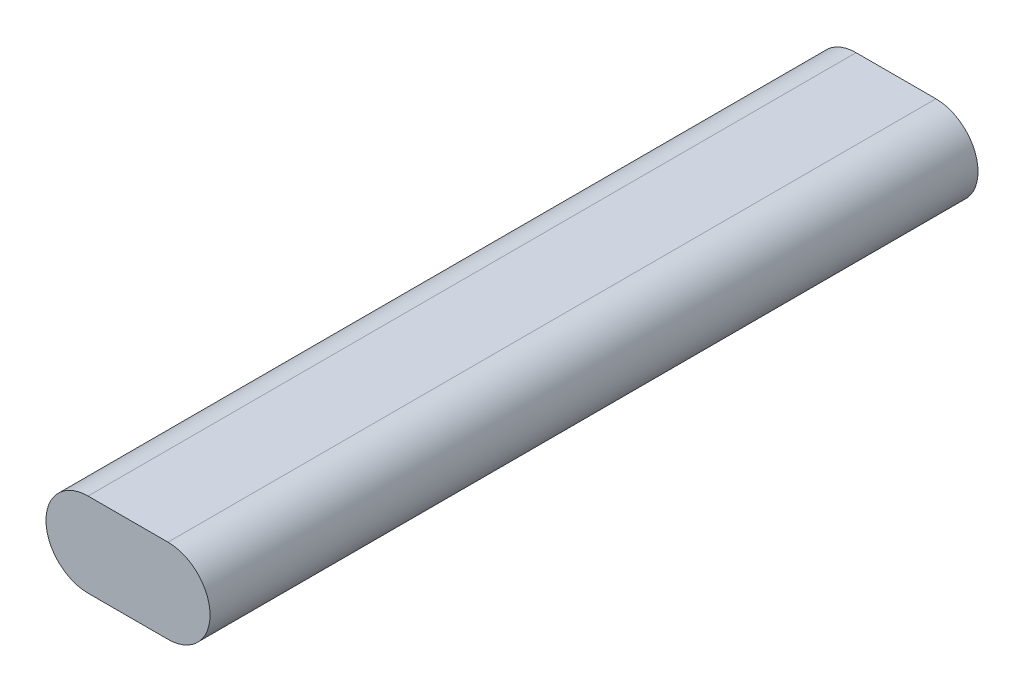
from build123d import *

# Parameters (mm, degrees)
BOSS_EXTRUDE1_DEPTH = 317.5


with BuildPart() as part:
    # Sketch1 → Boss-Extrude1 (new body)
    with BuildSketch(Plane.XY):
        with BuildLine():
            Line((0, 17.399), (33.02, 17.399))
            ThreePointArc((33.02, 17.399), (50.419, 0), (33.02, -17.399))
            Line((33.02, -17.399), (0, -17.399))
            ThreePointArc((0, -17.399), (-17.399, 0), (0, 17.399))
        make_face()
    extrude(amount=BOSS_EXTRUDE1_DEPTH)


solid = part.part
